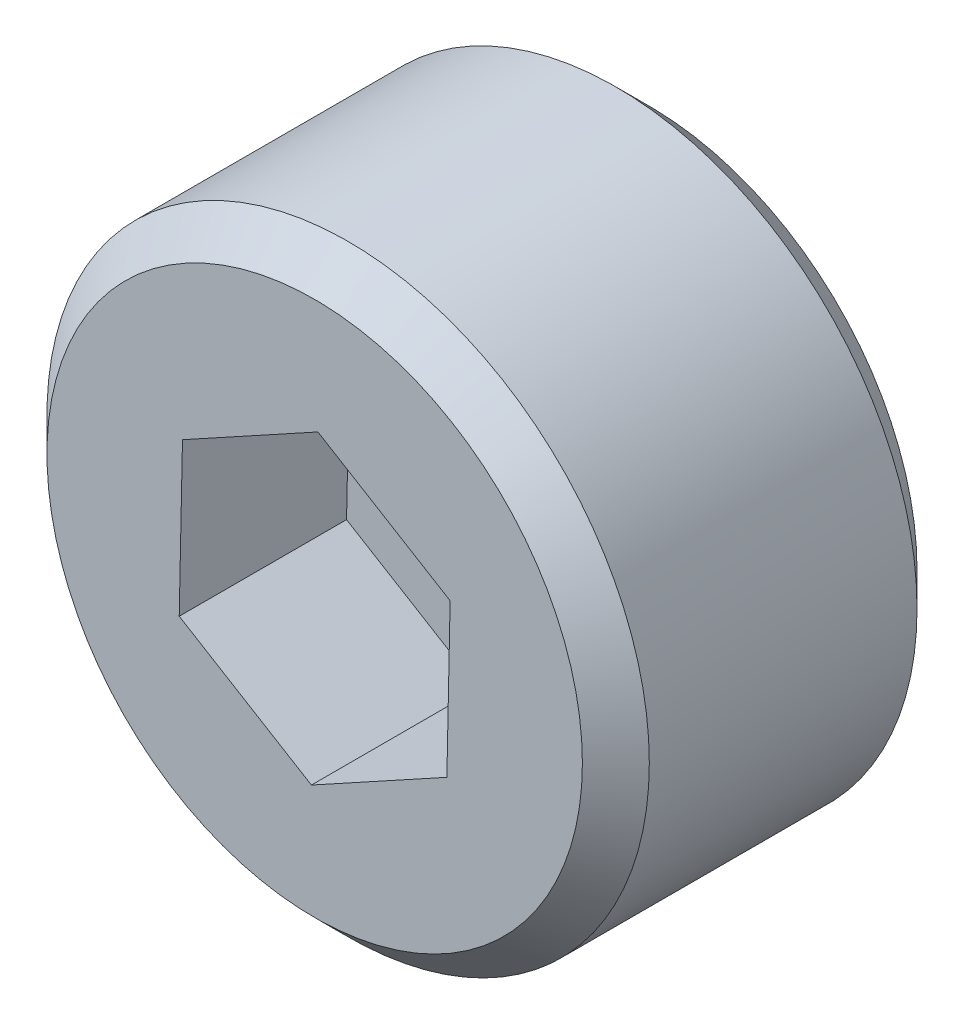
ISO-10303-21;
HEADER;
FILE_DESCRIPTION(('STEP AP214'),'2;1');
FILE_NAME('part.step','',(''),(''),'','','');
FILE_SCHEMA(('AUTOMOTIVE_DESIGN { 1 0 10303 214 1 1 1 1 }'));
ENDSEC;
DATA;
#1=APPLICATION_CONTEXT('core data for automotive mechanical design processes');
#2=APPLICATION_PROTOCOL_DEFINITION('international standard','automotive_design',2000,#1);
#3=PRODUCT_CONTEXT('',#1,'mechanical');
#4=PRODUCT('Part','Part','',(#3));
#5=PRODUCT_RELATED_PRODUCT_CATEGORY('part','',(#4));
#6=PRODUCT_DEFINITION_FORMATION('','',#4);
#7=PRODUCT_DEFINITION_CONTEXT('part definition',#1,'design');
#8=PRODUCT_DEFINITION('design','',#6,#7);
#9=PRODUCT_DEFINITION_SHAPE('','',#8);
#10=(LENGTH_UNIT() NAMED_UNIT(*) SI_UNIT(.MILLI.,.METRE.));
#11=(NAMED_UNIT(*) PLANE_ANGLE_UNIT() SI_UNIT($,.RADIAN.));
#12=(NAMED_UNIT(*) SI_UNIT($,.STERADIAN.) SOLID_ANGLE_UNIT());
#13=UNCERTAINTY_MEASURE_WITH_UNIT(LENGTH_MEASURE(1.E-05),#10,'distance_accuracy_value','');
#14=(GEOMETRIC_REPRESENTATION_CONTEXT(3) GLOBAL_UNCERTAINTY_ASSIGNED_CONTEXT((#13)) GLOBAL_UNIT_ASSIGNED_CONTEXT((#10,
#11,#12)) REPRESENTATION_CONTEXT('',''));
#15=CARTESIAN_POINT('',(0.,0.,0.));
#16=DIRECTION('',(0.,0.,1.));
#17=DIRECTION('',(1.,0.,0.));
#18=AXIS2_PLACEMENT_3D('',#15,#16,#17);
#19=CARTESIAN_POINT('',(0.,0.,10.));
#20=DIRECTION('',(0.,0.,-1.));
#21=DIRECTION('',(-1.,0.,0.));
#22=AXIS2_PLACEMENT_3D('',#19,#20,#21);
#23=CYLINDRICAL_SURFACE('',#22,9.);
#24=CARTESIAN_POINT('',(0.,0.,1.));
#25=DIRECTION('',(0.,0.,1.));
#26=DIRECTION('',(1.,0.,0.));
#27=AXIS2_PLACEMENT_3D('',#24,#25,#26);
#28=CIRCLE('',#27,9.);
#29=CARTESIAN_POINT('',(9.,0.,1.));
#30=VERTEX_POINT('',#29);
#31=EDGE_CURVE('E143',#30,#30,#28,.T.);
#32=ORIENTED_EDGE('',*,*,#31,.T.);
#33=EDGE_LOOP('',(#32));
#34=FACE_BOUND('',#33,.T.);
#35=CARTESIAN_POINT('',(0.,0.,9.00000000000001));
#36=DIRECTION('',(0.,0.,1.));
#37=DIRECTION('',(1.,0.,0.));
#38=AXIS2_PLACEMENT_3D('',#35,#36,#37);
#39=CIRCLE('',#38,9.);
#40=CARTESIAN_POINT('',(9.,0.,9.00000000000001));
#41=VERTEX_POINT('',#40);
#42=EDGE_CURVE('E135',#41,#41,#39,.F.);
#43=ORIENTED_EDGE('',*,*,#42,.T.);
#44=EDGE_LOOP('',(#43));
#45=FACE_BOUND('',#44,.T.);
#46=ADVANCED_FACE('F33',(#34,#45),#23,.T.);
#47=CARTESIAN_POINT('',(0.,0.,10.));
#48=DIRECTION('',(0.,0.,1.));
#49=DIRECTION('',(1.,0.,0.));
#50=AXIS2_PLACEMENT_3D('',#47,#48,#49);
#51=PLANE('',#50);
#52=CARTESIAN_POINT('',(0.,0.,10.));
#53=DIRECTION('',(0.,0.,1.));
#54=DIRECTION('',(1.,0.,0.));
#55=AXIS2_PLACEMENT_3D('',#52,#53,#54);
#56=CIRCLE('',#55,8.00000000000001);
#57=CARTESIAN_POINT('',(8.00000000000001,0.,10.));
#58=VERTEX_POINT('',#57);
#59=EDGE_CURVE('E11',#58,#58,#56,.T.);
#60=ORIENTED_EDGE('',*,*,#59,.T.);
#61=EDGE_LOOP('',(#60));
#62=FACE_BOUND('',#61,.T.);
#63=DIRECTION('',(-0.876389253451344,-0.481603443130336,0.));
#64=VECTOR('',#63,1.);
#65=CARTESIAN_POINT('',(0.0975205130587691,4.61777252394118,10.));
#66=LINE('',#65,#64);
#67=CARTESIAN_POINT('',(0.0975205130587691,4.61777252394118,10.));
#68=VERTEX_POINT('',#67);
#69=CARTESIAN_POINT('',(-3.95034805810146,2.39334150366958,10.));
#70=VERTEX_POINT('',#69);
#71=EDGE_CURVE('E48',#68,#70,#66,.T.);
#72=ORIENTED_EDGE('',*,*,#71,.F.);
#73=DIRECTION('',(-0.855275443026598,0.518173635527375,0.));
#74=VECTOR('',#73,1.);
#75=CARTESIAN_POINT('',(4.04786857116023,2.2244310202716,10.));
#76=LINE('',#75,#74);
#77=CARTESIAN_POINT('',(4.04786857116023,2.2244310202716,10.));
#78=VERTEX_POINT('',#77);
#79=EDGE_CURVE('E131',#78,#68,#76,.T.);
#80=ORIENTED_EDGE('',*,*,#79,.F.);
#81=DIRECTION('',(0.0211138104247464,0.999777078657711,0.));
#82=VECTOR('',#81,1.);
#83=CARTESIAN_POINT('',(3.95034805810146,-2.39334150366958,10.));
#84=LINE('',#83,#82);
#85=CARTESIAN_POINT('',(3.95034805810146,-2.39334150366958,10.));
#86=VERTEX_POINT('',#85);
#87=EDGE_CURVE('E129',#86,#78,#84,.T.);
#88=ORIENTED_EDGE('',*,*,#87,.F.);
#89=DIRECTION('',(0.876389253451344,0.481603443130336,0.));
#90=VECTOR('',#89,1.);
#91=CARTESIAN_POINT('',(-0.0975205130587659,-4.61777252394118,10.));
#92=LINE('',#91,#90);
#93=CARTESIAN_POINT('',(-0.0975205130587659,-4.61777252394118,10.));
#94=VERTEX_POINT('',#93);
#95=EDGE_CURVE('E96',#94,#86,#92,.T.);
#96=ORIENTED_EDGE('',*,*,#95,.F.);
#97=DIRECTION('',(0.855275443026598,-0.518173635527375,0.));
#98=VECTOR('',#97,1.);
#99=CARTESIAN_POINT('',(-4.04786857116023,-2.2244310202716,10.));
#100=LINE('',#99,#98);
#101=CARTESIAN_POINT('',(-4.04786857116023,-2.2244310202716,10.));
#102=VERTEX_POINT('',#101);
#103=EDGE_CURVE('E125',#102,#94,#100,.T.);
#104=ORIENTED_EDGE('',*,*,#103,.F.);
#105=DIRECTION('',(-0.0211138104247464,-0.999777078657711,0.));
#106=VECTOR('',#105,1.);
#107=CARTESIAN_POINT('',(-3.95034805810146,2.39334150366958,10.));
#108=LINE('',#107,#106);
#109=EDGE_CURVE('E122',#70,#102,#108,.T.);
#110=ORIENTED_EDGE('',*,*,#109,.F.);
#111=EDGE_LOOP('',(#72,#80,#88,#96,#104,#110));
#112=FACE_BOUND('',#111,.T.);
#113=ADVANCED_FACE('F157',(#62,#112),#51,.T.);
#114=CARTESIAN_POINT('',(0.,0.,0.));
#115=DIRECTION('',(0.,0.,1.));
#116=DIRECTION('',(1.,0.,0.));
#117=AXIS2_PLACEMENT_3D('',#114,#115,#116);
#118=PLANE('',#117);
#119=CARTESIAN_POINT('',(0.,0.,0.));
#120=DIRECTION('',(0.,0.,1.));
#121=DIRECTION('',(1.,0.,0.));
#122=AXIS2_PLACEMENT_3D('',#119,#120,#121);
#123=CIRCLE('',#122,7.99999999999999);
#124=CARTESIAN_POINT('',(7.99999999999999,0.,0.));
#125=VERTEX_POINT('',#124);
#126=EDGE_CURVE('E41',#125,#125,#123,.F.);
#127=ORIENTED_EDGE('',*,*,#126,.T.);
#128=EDGE_LOOP('',(#127));
#129=FACE_BOUND('',#128,.T.);
#130=ADVANCED_FACE('F148',(#129),#118,.F.);
#131=CARTESIAN_POINT('',(0.0975205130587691,4.61777252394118,5.));
#132=DIRECTION('',(-0.481603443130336,0.876389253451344,0.));
#133=DIRECTION('',(-0.876389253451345,-0.481603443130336,0.));
#134=AXIS2_PLACEMENT_3D('',#131,#132,#133);
#135=PLANE('',#134);
#136=ORIENTED_EDGE('',*,*,#71,.T.);
#137=DIRECTION('',(0.,0.,1.));
#138=VECTOR('',#137,1.);
#139=CARTESIAN_POINT('',(-3.95034805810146,2.39334150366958,5.));
#140=LINE('',#139,#138);
#141=CARTESIAN_POINT('',(-3.95034805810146,2.39334150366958,5.));
#142=VERTEX_POINT('',#141);
#143=EDGE_CURVE('E78',#142,#70,#140,.T.);
#144=ORIENTED_EDGE('',*,*,#143,.F.);
#145=DIRECTION('',(-0.876389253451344,-0.481603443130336,0.));
#146=VECTOR('',#145,1.);
#147=CARTESIAN_POINT('',(0.0975205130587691,4.61777252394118,5.));
#148=LINE('',#147,#146);
#149=CARTESIAN_POINT('',(0.0975205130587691,4.61777252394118,5.));
#150=VERTEX_POINT('',#149);
#151=EDGE_CURVE('E133',#150,#142,#148,.T.);
#152=ORIENTED_EDGE('',*,*,#151,.F.);
#153=DIRECTION('',(0.,0.,1.));
#154=VECTOR('',#153,1.);
#155=CARTESIAN_POINT('',(0.0975205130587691,4.61777252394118,5.));
#156=LINE('',#155,#154);
#157=EDGE_CURVE('E56',#150,#68,#156,.T.);
#158=ORIENTED_EDGE('',*,*,#157,.T.);
#159=EDGE_LOOP('',(#136,#144,#152,#158));
#160=FACE_BOUND('',#159,.T.);
#161=ADVANCED_FACE('F174',(#160),#135,.F.);
#162=CARTESIAN_POINT('',(4.04786857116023,2.2244310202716,5.));
#163=DIRECTION('',(0.518173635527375,0.855275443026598,0.));
#164=DIRECTION('',(-0.855275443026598,0.518173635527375,0.));
#165=AXIS2_PLACEMENT_3D('',#162,#163,#164);
#166=PLANE('',#165);
#167=ORIENTED_EDGE('',*,*,#79,.T.);
#168=ORIENTED_EDGE('',*,*,#157,.F.);
#169=DIRECTION('',(-0.855275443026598,0.518173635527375,0.));
#170=VECTOR('',#169,1.);
#171=CARTESIAN_POINT('',(4.04786857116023,2.2244310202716,5.));
#172=LINE('',#171,#170);
#173=CARTESIAN_POINT('',(4.04786857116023,2.2244310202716,5.));
#174=VERTEX_POINT('',#173);
#175=EDGE_CURVE('E108',#174,#150,#172,.T.);
#176=ORIENTED_EDGE('',*,*,#175,.F.);
#177=DIRECTION('',(0.,0.,1.));
#178=VECTOR('',#177,1.);
#179=CARTESIAN_POINT('',(4.04786857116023,2.2244310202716,5.));
#180=LINE('',#179,#178);
#181=EDGE_CURVE('E100',#174,#78,#180,.T.);
#182=ORIENTED_EDGE('',*,*,#181,.T.);
#183=EDGE_LOOP('',(#167,#168,#176,#182));
#184=FACE_BOUND('',#183,.T.);
#185=ADVANCED_FACE('F176',(#184),#166,.F.);
#186=CARTESIAN_POINT('',(3.95034805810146,-2.39334150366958,5.));
#187=DIRECTION('',(0.999777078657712,-0.0211138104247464,0.));
#188=DIRECTION('',(0.0211138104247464,0.999777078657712,0.));
#189=AXIS2_PLACEMENT_3D('',#186,#187,#188);
#190=PLANE('',#189);
#191=ORIENTED_EDGE('',*,*,#87,.T.);
#192=ORIENTED_EDGE('',*,*,#181,.F.);
#193=DIRECTION('',(0.0211138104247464,0.999777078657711,0.));
#194=VECTOR('',#193,1.);
#195=CARTESIAN_POINT('',(3.95034805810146,-2.39334150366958,5.));
#196=LINE('',#195,#194);
#197=CARTESIAN_POINT('',(3.95034805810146,-2.39334150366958,5.));
#198=VERTEX_POINT('',#197);
#199=EDGE_CURVE('E104',#198,#174,#196,.T.);
#200=ORIENTED_EDGE('',*,*,#199,.F.);
#201=DIRECTION('',(0.,0.,1.));
#202=VECTOR('',#201,1.);
#203=CARTESIAN_POINT('',(3.95034805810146,-2.39334150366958,5.));
#204=LINE('',#203,#202);
#205=EDGE_CURVE('E89',#198,#86,#204,.T.);
#206=ORIENTED_EDGE('',*,*,#205,.T.);
#207=EDGE_LOOP('',(#191,#192,#200,#206));
#208=FACE_BOUND('',#207,.T.);
#209=ADVANCED_FACE('F105',(#208),#190,.F.);
#210=CARTESIAN_POINT('',(-0.0975205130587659,-4.61777252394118,5.));
#211=DIRECTION('',(0.481603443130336,-0.876389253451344,0.));
#212=DIRECTION('',(0.876389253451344,0.481603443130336,0.));
#213=AXIS2_PLACEMENT_3D('',#210,#211,#212);
#214=PLANE('',#213);
#215=ORIENTED_EDGE('',*,*,#95,.T.);
#216=ORIENTED_EDGE('',*,*,#205,.F.);
#217=DIRECTION('',(0.876389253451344,0.481603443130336,0.));
#218=VECTOR('',#217,1.);
#219=CARTESIAN_POINT('',(-0.0975205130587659,-4.61777252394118,5.));
#220=LINE('',#219,#218);
#221=CARTESIAN_POINT('',(-0.0975205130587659,-4.61777252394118,5.));
#222=VERTEX_POINT('',#221);
#223=EDGE_CURVE('E93',#222,#198,#220,.T.);
#224=ORIENTED_EDGE('',*,*,#223,.F.);
#225=DIRECTION('',(0.,0.,1.));
#226=VECTOR('',#225,1.);
#227=CARTESIAN_POINT('',(-0.0975205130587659,-4.61777252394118,5.));
#228=LINE('',#227,#226);
#229=EDGE_CURVE('E101',#222,#94,#228,.T.);
#230=ORIENTED_EDGE('',*,*,#229,.T.);
#231=EDGE_LOOP('',(#215,#216,#224,#230));
#232=FACE_BOUND('',#231,.T.);
#233=ADVANCED_FACE('F91',(#232),#214,.F.);
#234=CARTESIAN_POINT('',(-4.04786857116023,-2.2244310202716,5.));
#235=DIRECTION('',(-0.518173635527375,-0.855275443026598,0.));
#236=DIRECTION('',(0.855275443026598,-0.518173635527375,0.));
#237=AXIS2_PLACEMENT_3D('',#234,#235,#236);
#238=PLANE('',#237);
#239=ORIENTED_EDGE('',*,*,#103,.T.);
#240=ORIENTED_EDGE('',*,*,#229,.F.);
#241=DIRECTION('',(0.855275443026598,-0.518173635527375,0.));
#242=VECTOR('',#241,1.);
#243=CARTESIAN_POINT('',(-4.04786857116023,-2.2244310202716,5.));
#244=LINE('',#243,#242);
#245=CARTESIAN_POINT('',(-4.04786857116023,-2.2244310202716,5.));
#246=VERTEX_POINT('',#245);
#247=EDGE_CURVE('E114',#246,#222,#244,.T.);
#248=ORIENTED_EDGE('',*,*,#247,.F.);
#249=DIRECTION('',(0.,0.,1.));
#250=VECTOR('',#249,1.);
#251=CARTESIAN_POINT('',(-4.04786857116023,-2.2244310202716,5.));
#252=LINE('',#251,#250);
#253=EDGE_CURVE('E138',#246,#102,#252,.T.);
#254=ORIENTED_EDGE('',*,*,#253,.T.);
#255=EDGE_LOOP('',(#239,#240,#248,#254));
#256=FACE_BOUND('',#255,.T.);
#257=ADVANCED_FACE('F187',(#256),#238,.F.);
#258=CARTESIAN_POINT('',(-3.95034805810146,2.39334150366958,5.));
#259=DIRECTION('',(-0.999777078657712,0.0211138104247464,0.));
#260=DIRECTION('',(-0.0211138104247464,-0.999777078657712,0.));
#261=AXIS2_PLACEMENT_3D('',#258,#259,#260);
#262=PLANE('',#261);
#263=ORIENTED_EDGE('',*,*,#109,.T.);
#264=ORIENTED_EDGE('',*,*,#253,.F.);
#265=DIRECTION('',(-0.0211138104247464,-0.999777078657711,0.));
#266=VECTOR('',#265,1.);
#267=CARTESIAN_POINT('',(-3.95034805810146,2.39334150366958,5.));
#268=LINE('',#267,#266);
#269=EDGE_CURVE('E116',#142,#246,#268,.T.);
#270=ORIENTED_EDGE('',*,*,#269,.F.);
#271=ORIENTED_EDGE('',*,*,#143,.T.);
#272=EDGE_LOOP('',(#263,#264,#270,#271));
#273=FACE_BOUND('',#272,.T.);
#274=ADVANCED_FACE('F172',(#273),#262,.F.);
#275=CARTESIAN_POINT('',(0.,0.,5.));
#276=DIRECTION('',(0.,0.,1.));
#277=DIRECTION('',(1.,0.,0.));
#278=AXIS2_PLACEMENT_3D('',#275,#276,#277);
#279=PLANE('',#278);
#280=ORIENTED_EDGE('',*,*,#151,.T.);
#281=ORIENTED_EDGE('',*,*,#269,.T.);
#282=ORIENTED_EDGE('',*,*,#247,.T.);
#283=ORIENTED_EDGE('',*,*,#223,.T.);
#284=ORIENTED_EDGE('',*,*,#199,.T.);
#285=ORIENTED_EDGE('',*,*,#175,.T.);
#286=EDGE_LOOP('',(#280,#281,#282,#283,#284,#285));
#287=FACE_BOUND('',#286,.T.);
#288=ADVANCED_FACE('F111',(#287),#279,.T.);
#289=CARTESIAN_POINT('',(0.,0.,1.));
#290=DIRECTION('',(0.,0.,1.));
#291=DIRECTION('',(1.,0.,0.));
#292=AXIS2_PLACEMENT_3D('',#289,#290,#291);
#293=CONICAL_SURFACE('',#292,9.,0.785398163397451);
#294=ORIENTED_EDGE('',*,*,#126,.F.);
#295=EDGE_LOOP('',(#294));
#296=FACE_BOUND('',#295,.T.);
#297=ORIENTED_EDGE('',*,*,#31,.F.);
#298=EDGE_LOOP('',(#297));
#299=FACE_BOUND('',#298,.T.);
#300=ADVANCED_FACE('F150',(#296,#299),#293,.T.);
#301=CARTESIAN_POINT('',(0.,0.,10.));
#302=DIRECTION('',(0.,0.,-1.));
#303=DIRECTION('',(-1.,0.,0.));
#304=AXIS2_PLACEMENT_3D('',#301,#302,#303);
#305=CONICAL_SURFACE('',#304,8.00000000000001,0.785398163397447);
#306=ORIENTED_EDGE('',*,*,#42,.F.);
#307=EDGE_LOOP('',(#306));
#308=FACE_BOUND('',#307,.T.);
#309=ORIENTED_EDGE('',*,*,#59,.F.);
#310=EDGE_LOOP('',(#309));
#311=FACE_BOUND('',#310,.T.);
#312=ADVANCED_FACE('F35',(#308,#311),#305,.T.);
#313=CLOSED_SHELL('',(#46,#113,#130,#161,#185,#209,#233,#257,#274,#288,#300,#312));
#314=MANIFOLD_SOLID_BREP('B2',#313);
#315=ADVANCED_BREP_SHAPE_REPRESENTATION('',(#18,#314),#14);
#316=SHAPE_DEFINITION_REPRESENTATION(#9,#315);
ENDSEC;
END-ISO-10303-21;
